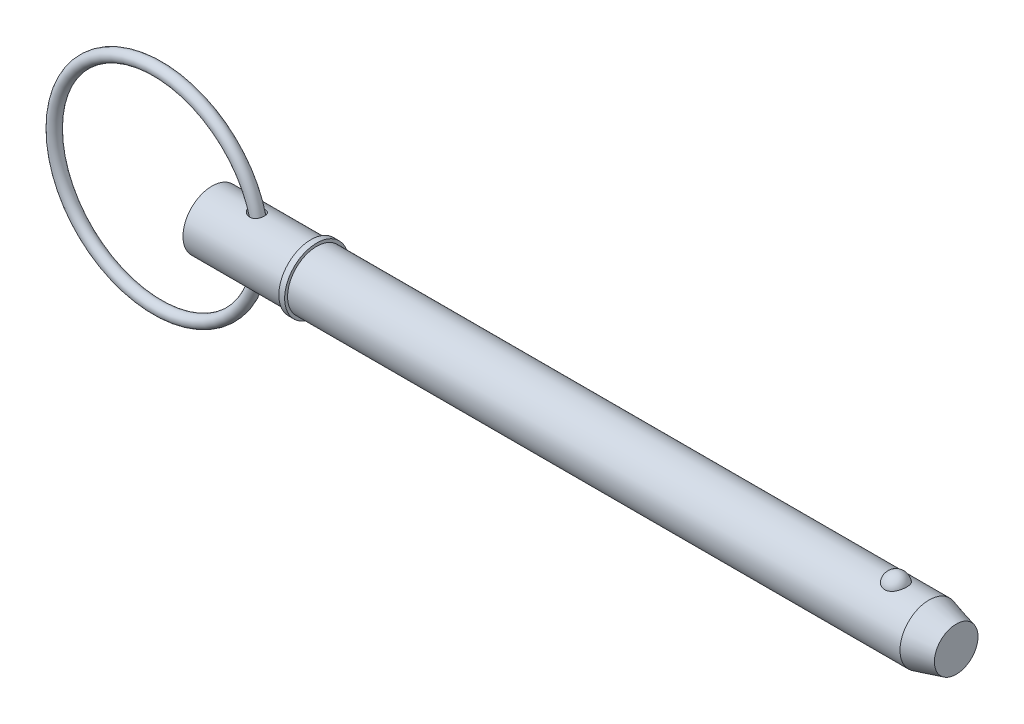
ISO-10303-21;
HEADER;
FILE_DESCRIPTION(('STEP AP214'),'2;1');
FILE_NAME('part.step','',(''),(''),'','','');
FILE_SCHEMA(('AUTOMOTIVE_DESIGN { 1 0 10303 214 1 1 1 1 }'));
ENDSEC;
DATA;
#1=APPLICATION_CONTEXT('core data for automotive mechanical design processes');
#2=APPLICATION_PROTOCOL_DEFINITION('international standard','automotive_design',2000,#1);
#3=PRODUCT_CONTEXT('',#1,'mechanical');
#4=PRODUCT('Part','Part','',(#3));
#5=PRODUCT_RELATED_PRODUCT_CATEGORY('part','',(#4));
#6=PRODUCT_DEFINITION_FORMATION('','',#4);
#7=PRODUCT_DEFINITION_CONTEXT('part definition',#1,'design');
#8=PRODUCT_DEFINITION('design','',#6,#7);
#9=PRODUCT_DEFINITION_SHAPE('','',#8);
#10=(LENGTH_UNIT() NAMED_UNIT(*) SI_UNIT(.MILLI.,.METRE.));
#11=(NAMED_UNIT(*) PLANE_ANGLE_UNIT() SI_UNIT($,.RADIAN.));
#12=(NAMED_UNIT(*) SI_UNIT($,.STERADIAN.) SOLID_ANGLE_UNIT());
#13=UNCERTAINTY_MEASURE_WITH_UNIT(LENGTH_MEASURE(1.E-05),#10,'distance_accuracy_value','');
#14=(GEOMETRIC_REPRESENTATION_CONTEXT(3) GLOBAL_UNCERTAINTY_ASSIGNED_CONTEXT((#13)) GLOBAL_UNIT_ASSIGNED_CONTEXT((#10,
#11,#12)) REPRESENTATION_CONTEXT('',''));
#15=CARTESIAN_POINT('',(0.,0.,0.));
#16=DIRECTION('',(0.,0.,1.));
#17=DIRECTION('',(1.,0.,0.));
#18=AXIS2_PLACEMENT_3D('',#15,#16,#17);
#19=CARTESIAN_POINT('',(-13.3805387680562,0.,0.));
#20=DIRECTION('',(0.,0.,1.));
#21=DIRECTION('',(1.,0.,0.));
#22=AXIS2_PLACEMENT_3D('',#19,#20,#21);
#23=TOROIDAL_SURFACE('',#22,25.4,1.429);
#24=CARTESIAN_POINT('',(13.4484612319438,0.,0.));
#25=VERTEX_POINT('',#24);
#26=VERTEX_LOOP('',#25);
#27=FACE_BOUND('',#26,.T.);
#28=ADVANCED_FACE('P0_F12',(#27),#23,.T.);
#29=CLOSED_SHELL('',(#28));
#30=MANIFOLD_SOLID_BREP('P0_B1',#29);
#31=CARTESIAN_POINT('',(0.,0.,0.));
#32=DIRECTION('',(1.,0.,0.));
#33=DIRECTION('',(0.,0.,-1.));
#34=AXIS2_PLACEMENT_3D('',#31,#32,#33);
#35=CYLINDRICAL_SURFACE('',#34,7.145);
#36=CARTESIAN_POINT('',(9.43029029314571,7.0820748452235,-0.94617170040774));
#37=CARTESIAN_POINT('',(9.49289741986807,7.07004660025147,-1.03619677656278));
#38=CARTESIAN_POINT('',(9.56370593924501,7.05703049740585,-1.12049617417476));
#39=CARTESIAN_POINT('',(9.71869321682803,7.03060933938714,-1.27585605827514));
#40=CARTESIAN_POINT('',(9.80290151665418,7.01720347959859,-1.34688652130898));
#41=CARTESIAN_POINT('',(9.98160385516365,6.99158714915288,-1.47408585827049));
#42=CARTESIAN_POINT('',(10.0760626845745,6.97937284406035,-1.53030346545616));
#43=CARTESIAN_POINT('',(10.2729508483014,6.95747410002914,-1.62697341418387));
#44=CARTESIAN_POINT('',(10.3753769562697,6.9477886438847,-1.66743209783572));
#45=CARTESIAN_POINT('',(10.5898946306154,6.93181594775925,-1.73266776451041));
#46=CARTESIAN_POINT('',(10.7022085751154,6.92567913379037,-1.75675727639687));
#47=CARTESIAN_POINT('',(10.9294935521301,6.91839634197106,-1.78523005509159));
#48=CARTESIAN_POINT('',(11.0444638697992,6.91724903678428,-1.78961856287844));
#49=CARTESIAN_POINT('',(11.2673249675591,6.92023954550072,-1.77801517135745));
#50=CARTESIAN_POINT('',(11.3752729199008,6.9241055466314,-1.7630715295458));
#51=CARTESIAN_POINT('',(11.5865707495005,6.93632220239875,-1.71437618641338));
#52=CARTESIAN_POINT('',(11.6899227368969,6.94467077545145,-1.68063321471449));
#53=CARTESIAN_POINT('',(11.8814537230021,6.96412118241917,-1.59802791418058));
#54=CARTESIAN_POINT('',(11.9701885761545,6.97498839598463,-1.55039425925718));
#55=CARTESIAN_POINT('',(12.1379548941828,6.99847346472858,-1.44066970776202));
#56=CARTESIAN_POINT('',(12.216987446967,7.01109112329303,-1.37858043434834));
#57=CARTESIAN_POINT('',(12.3614636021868,7.03632910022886,-1.24326778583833));
#58=CARTESIAN_POINT('',(12.4271729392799,7.04894297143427,-1.17032635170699));
#59=CARTESIAN_POINT('',(12.5455377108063,7.07306867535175,-1.01436746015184));
#60=CARTESIAN_POINT('',(12.5981928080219,7.08458047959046,-0.931349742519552));
#61=CARTESIAN_POINT('',(12.6896059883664,7.10535787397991,-0.756770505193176));
#62=CARTESIAN_POINT('',(12.7282356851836,7.11460247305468,-0.665139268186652));
#63=CARTESIAN_POINT('',(12.7900431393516,7.12971795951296,-0.476541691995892));
#64=CARTESIAN_POINT('',(12.8132203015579,7.13558871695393,-0.379575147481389));
#65=CARTESIAN_POINT('',(12.843715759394,7.14336270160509,-0.182249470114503));
#66=CARTESIAN_POINT('',(12.8509095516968,7.14523477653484,-0.081869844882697));
#67=CARTESIAN_POINT('',(12.8489064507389,7.14471772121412,0.118715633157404));
#68=CARTESIAN_POINT('',(12.8397092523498,7.14232851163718,0.218921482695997));
#69=CARTESIAN_POINT('',(12.8051110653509,7.13353949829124,0.41644658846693));
#70=CARTESIAN_POINT('',(12.7796895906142,7.12713462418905,0.513762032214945));
#71=CARTESIAN_POINT('',(12.7132079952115,7.1110024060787,0.702607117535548));
#72=CARTESIAN_POINT('',(12.6721476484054,7.10127501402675,0.79413667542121));
#73=CARTESIAN_POINT('',(12.5754142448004,7.07957648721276,0.968687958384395));
#74=CARTESIAN_POINT('',(12.5197583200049,7.06760798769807,1.05171950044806));
#75=CARTESIAN_POINT('',(12.3951873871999,7.04275315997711,1.20699878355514));
#76=CARTESIAN_POINT('',(12.3262733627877,7.02986689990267,1.27924732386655));
#77=CARTESIAN_POINT('',(12.1775943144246,7.00473797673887,1.41035599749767));
#78=CARTESIAN_POINT('',(12.0979195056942,6.99249102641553,1.46931758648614));
#79=CARTESIAN_POINT('',(11.9295314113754,6.96991222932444,1.57295053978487));
#80=CARTESIAN_POINT('',(11.840819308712,6.9595801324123,1.61762377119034));
#81=CARTESIAN_POINT('',(11.6577653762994,6.9420462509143,1.69128599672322));
#82=CARTESIAN_POINT('',(11.5634812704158,6.93481718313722,1.72041226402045));
#83=CARTESIAN_POINT('',(11.3712731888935,6.92407027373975,1.76316901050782));
#84=CARTESIAN_POINT('',(11.2733489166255,6.92055273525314,1.7767982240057));
#85=CARTESIAN_POINT('',(11.0745092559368,6.91745053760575,1.78883853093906));
#86=CARTESIAN_POINT('',(10.9735737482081,6.91794816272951,1.7869312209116));
#87=CARTESIAN_POINT('',(10.7732766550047,6.92286647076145,1.76777696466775));
#88=CARTESIAN_POINT('',(10.6739155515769,6.92728833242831,1.75052540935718));
#89=CARTESIAN_POINT('',(10.4726907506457,6.93987626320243,1.69995986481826));
#90=CARTESIAN_POINT('',(10.3710860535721,6.94826759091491,1.66567223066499));
#91=CARTESIAN_POINT('',(10.1746512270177,6.96783543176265,1.5818155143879));
#92=CARTESIAN_POINT('',(10.0798244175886,6.97901329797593,1.53223900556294));
#93=CARTESIAN_POINT('',(9.89353725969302,7.00369413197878,1.41530336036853));
#94=CARTESIAN_POINT('',(9.80266896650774,7.01729943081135,1.34701798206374));
#95=CARTESIAN_POINT('',(9.63408859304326,7.0446567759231,1.19571433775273));
#96=CARTESIAN_POINT('',(9.55637809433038,7.05840883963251,1.11269430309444));
#97=CARTESIAN_POINT('',(9.41909992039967,7.083998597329,0.935821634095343));
#98=CARTESIAN_POINT('',(9.35912834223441,7.09587546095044,0.842290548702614));
#99=CARTESIAN_POINT('',(9.25811978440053,7.11649414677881,0.645207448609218));
#100=CARTESIAN_POINT('',(9.21705789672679,7.12524008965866,0.541668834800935));
#101=CARTESIAN_POINT('',(9.16044503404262,7.13745944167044,0.341322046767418));
#102=CARTESIAN_POINT('',(9.14237352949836,7.14144984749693,0.245257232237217));
#103=CARTESIAN_POINT('',(9.12416132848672,7.14547143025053,0.0513577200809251));
#104=CARTESIAN_POINT('',(9.12401221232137,7.14550446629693,-0.0464761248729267));
#105=CARTESIAN_POINT('',(9.14075660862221,7.14180686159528,-0.230866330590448));
#106=CARTESIAN_POINT('',(9.15598246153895,7.13844450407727,-0.317588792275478));
#107=CARTESIAN_POINT('',(9.20015637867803,7.1288735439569,-0.487231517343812));
#108=CARTESIAN_POINT('',(9.22909411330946,7.12266708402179,-0.570154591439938));
#109=CARTESIAN_POINT('',(9.2869632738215,7.11060500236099,-0.702183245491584));
#110=CARTESIAN_POINT('',(9.3123377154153,7.10538970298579,-0.752949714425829));
#111=CARTESIAN_POINT('',(9.36784352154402,7.09422889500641,-0.851709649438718));
#112=CARTESIAN_POINT('',(9.39797435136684,7.08828346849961,-0.899703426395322));
#113=CARTESIAN_POINT('',(9.43029029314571,7.0820748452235,-0.94617170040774));
#114=B_SPLINE_CURVE_WITH_KNOTS('',3,(#36,#37,#38,#39,#40,#41,#42,#43,#44,#45,#46,#47,#48,#49,
#50,#51,#52,#53,#54,#55,#56,#57,#58,#59,#60,#61,#62,#63,#64,#65,#66,#67,#68,#69,#70,#71,#72,#73,
#74,#75,#76,#77,#78,#79,#80,#81,#82,#83,#84,#85,#86,#87,#88,#89,#90,#91,#92,#93,#94,#95,#96,#97,
#98,#99,#100,#101,#102,#103,#104,#105,#106,#107,#108,#109,#110,#111,#112,#113),.UNSPECIFIED.,
.T.,.F.,(4,2,2,2,2,2,2,2,2,2,2,2,2,2,2,2,2,2,2,2,2,2,2,2,2,2,2,2,2,2,2,2,2,2,2,2,2,2,4),(0.,
0.330712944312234,0.662165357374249,0.992513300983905,1.32272815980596,1.66607248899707,
2.00932547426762,2.33472339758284,2.65997034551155,2.96236844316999,3.26473260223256,
3.56029376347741,3.85586255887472,4.15407251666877,4.45229395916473,4.75283038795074,
5.05337241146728,5.35429467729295,5.6552212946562,5.95579625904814,6.25634893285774,
6.55452242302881,6.85265693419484,7.14811357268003,7.44359434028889,7.74514565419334,
8.04678757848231,8.36809025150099,8.68954924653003,9.03133562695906,9.37316306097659,
9.70647113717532,10.0393389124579,10.3311793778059,10.6228827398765,10.8860177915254,
11.1489549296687,11.3196783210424,11.4903825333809),.UNSPECIFIED.);
#115=CARTESIAN_POINT('',(9.43029029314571,7.0820748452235,-0.94617170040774));
#116=VERTEX_POINT('',#115);
#117=EDGE_CURVE('P1_E42',#116,#116,#114,.T.);
#118=ORIENTED_EDGE('',*,*,#117,.T.);
#119=EDGE_LOOP('',(#118));
#120=FACE_BOUND('',#119,.T.);
#121=CARTESIAN_POINT('',(0.,0.,0.));
#122=DIRECTION('',(1.,0.,0.));
#123=DIRECTION('',(0.,0.,-1.));
#124=AXIS2_PLACEMENT_3D('',#121,#122,#123);
#125=CIRCLE('',#124,7.145);
#126=CARTESIAN_POINT('',(0.,0.,-7.145));
#127=VERTEX_POINT('',#126);
#128=EDGE_CURVE('P1_E9',#127,#127,#125,.T.);
#129=ORIENTED_EDGE('',*,*,#128,.T.);
#130=EDGE_LOOP('',(#129));
#131=FACE_BOUND('',#130,.T.);
#132=CARTESIAN_POINT('',(24.271,0.,0.));
#133=DIRECTION('',(1.,0.,0.));
#134=DIRECTION('',(0.,0.,-1.));
#135=AXIS2_PLACEMENT_3D('',#132,#133,#134);
#136=CIRCLE('',#135,7.145);
#137=CARTESIAN_POINT('',(24.271,0.,-7.145));
#138=VERTEX_POINT('',#137);
#139=EDGE_CURVE('P1_E25',#138,#138,#136,.T.);
#140=ORIENTED_EDGE('',*,*,#139,.F.);
#141=EDGE_LOOP('',(#140));
#142=FACE_BOUND('',#141,.T.);
#143=CARTESIAN_POINT('',(9.43029029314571,-7.0820748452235,-0.94617170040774));
#144=CARTESIAN_POINT('',(9.37760063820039,-7.09219753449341,-0.870403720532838));
#145=CARTESIAN_POINT('',(9.33068640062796,-7.10162619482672,-0.790535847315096));
#146=CARTESIAN_POINT('',(9.25028000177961,-7.11818229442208,-0.624083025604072));
#147=CARTESIAN_POINT('',(9.21677847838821,-7.12531133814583,-0.53750281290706));
#148=CARTESIAN_POINT('',(9.16475883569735,-7.13651886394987,-0.359324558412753));
#149=CARTESIAN_POINT('',(9.14630423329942,-7.14058440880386,-0.267706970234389));
#150=CARTESIAN_POINT('',(9.12573334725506,-7.14512216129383,-0.082561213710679));
#151=CARTESIAN_POINT('',(9.12361335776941,-7.1455951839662,0.0109665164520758));
#152=CARTESIAN_POINT('',(9.13548667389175,-7.14296952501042,0.191627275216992));
#153=CARTESIAN_POINT('',(9.14858103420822,-7.14007009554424,0.278824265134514));
#154=CARTESIAN_POINT('',(9.18869656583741,-7.1313430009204,0.449782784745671));
#155=CARTESIAN_POINT('',(9.21571947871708,-7.1255149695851,0.533543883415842));
#156=CARTESIAN_POINT('',(9.282939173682,-7.11140544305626,0.696984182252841));
#157=CARTESIAN_POINT('',(9.32334793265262,-7.10308469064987,0.776572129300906));
#158=CARTESIAN_POINT('',(9.41555290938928,-7.08481187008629,0.928623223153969));
#159=CARTESIAN_POINT('',(9.4673531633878,-7.07485922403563,1.00108383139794));
#160=CARTESIAN_POINT('',(9.58690514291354,-7.05302654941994,1.14530893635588));
#161=CARTESIAN_POINT('',(9.65578345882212,-7.04105486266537,1.21612477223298));
#162=CARTESIAN_POINT('',(9.80342908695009,-7.01727063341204,1.34660507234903));
#163=CARTESIAN_POINT('',(9.88220203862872,-7.00545818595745,1.40626312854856));
#164=CARTESIAN_POINT('',(10.0573217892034,-6.9817739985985,1.51973713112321));
#165=CARTESIAN_POINT('',(10.1546474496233,-6.9700532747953,1.57208037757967));
#166=CARTESIAN_POINT('',(10.3567277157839,-6.94950828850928,1.66055104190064));
#167=CARTESIAN_POINT('',(10.4614845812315,-6.94068491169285,1.69667350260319));
#168=CARTESIAN_POINT('',(10.6792116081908,-6.92685379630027,1.75230777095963));
#169=CARTESIAN_POINT('',(10.7923373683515,-6.92197732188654,1.77125049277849));
#170=CARTESIAN_POINT('',(11.0202699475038,-6.91736328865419,1.78919210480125));
#171=CARTESIAN_POINT('',(11.1350759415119,-6.91762328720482,1.78820047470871));
#172=CARTESIAN_POINT('',(11.355627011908,-6.92328130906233,1.76615765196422));
#173=CARTESIAN_POINT('',(11.4615007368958,-6.92836826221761,1.74632083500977));
#174=CARTESIAN_POINT('',(11.6678083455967,-6.94272508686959,1.68833625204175));
#175=CARTESIAN_POINT('',(11.7682443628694,-6.9519933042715,1.65019572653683));
#176=CARTESIAN_POINT('',(11.9539217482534,-6.97285816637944,1.55957439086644));
#177=CARTESIAN_POINT('',(12.0397280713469,-6.98426147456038,1.50820229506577));
#178=CARTESIAN_POINT('',(12.2011249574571,-7.00842344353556,1.39160266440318));
#179=CARTESIAN_POINT('',(12.276716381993,-7.0211819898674,1.32637629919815));
#180=CARTESIAN_POINT('',(12.4144868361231,-7.04639315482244,1.18508369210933));
#181=CARTESIAN_POINT('',(12.4768620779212,-7.05884739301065,1.10920872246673));
#182=CARTESIAN_POINT('',(12.5881779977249,-7.08230185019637,0.947973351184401));
#183=CARTESIAN_POINT('',(12.6371182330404,-7.09330202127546,0.862612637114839));
#184=CARTESIAN_POINT('',(12.7208404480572,-7.11277016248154,0.683871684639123));
#185=CARTESIAN_POINT('',(12.7554736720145,-7.12121129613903,0.590418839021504));
#186=CARTESIAN_POINT('',(12.8090653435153,-7.13450309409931,0.398877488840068));
#187=CARTESIAN_POINT('',(12.8280232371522,-7.13935363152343,0.300788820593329));
#188=CARTESIAN_POINT('',(12.8499077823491,-7.14496695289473,0.102058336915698));
#189=CARTESIAN_POINT('',(12.8527265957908,-7.14570223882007,0.0014038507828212));
#190=CARTESIAN_POINT('',(12.8419792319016,-7.14293198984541,-0.198968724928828));
#191=CARTESIAN_POINT('',(12.8284127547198,-7.13942637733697,-0.298686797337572));
#192=CARTESIAN_POINT('',(12.7851853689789,-7.12854635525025,-0.494442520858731));
#193=CARTESIAN_POINT('',(12.7555107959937,-7.12116866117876,-0.590476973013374));
#194=CARTESIAN_POINT('',(12.6807437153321,-7.10334272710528,-0.776042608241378));
#195=CARTESIAN_POINT('',(12.6356510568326,-7.09289445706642,-0.865573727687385));
#196=CARTESIAN_POINT('',(12.5312128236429,-7.07009703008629,-1.03541867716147));
#197=CARTESIAN_POINT('',(12.4718917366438,-7.0577511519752,-1.11574799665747));
#198=CARTESIAN_POINT('',(12.3404461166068,-7.03252701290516,-1.26504204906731));
#199=CARTESIAN_POINT('',(12.2683227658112,-7.01964880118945,-1.33400783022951));
#200=CARTESIAN_POINT('',(12.1139052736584,-6.99493588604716,-1.45803732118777));
#201=CARTESIAN_POINT('',(12.031708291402,-6.98309284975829,-1.51322032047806));
#202=CARTESIAN_POINT('',(11.858962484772,-6.96164945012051,-1.60900039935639));
#203=CARTESIAN_POINT('',(11.7684146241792,-6.95204882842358,-1.6495991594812));
#204=CARTESIAN_POINT('',(11.5822744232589,-6.93618392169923,-1.71508374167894));
#205=CARTESIAN_POINT('',(11.4867225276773,-6.92989640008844,-1.74007923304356));
#206=CARTESIAN_POINT('',(11.292703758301,-6.92114809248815,-1.77455680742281));
#207=CARTESIAN_POINT('',(11.1942365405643,-6.91868775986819,-1.7840370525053));
#208=CARTESIAN_POINT('',(10.9943797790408,-6.91771041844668,-1.78782317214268));
#209=CARTESIAN_POINT('',(10.8929824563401,-6.9193005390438,-1.78171679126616));
#210=CARTESIAN_POINT('',(10.6924353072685,-6.92632816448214,-1.75419409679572));
#211=CARTESIAN_POINT('',(10.5932861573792,-6.93176681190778,-1.73277323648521));
#212=CARTESIAN_POINT('',(10.3927770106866,-6.94630717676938,-1.67356884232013));
#213=CARTESIAN_POINT('',(10.2917367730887,-6.95563581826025,-1.63475796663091));
#214=CARTESIAN_POINT('',(10.0971768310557,-6.97681957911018,-1.54184188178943));
#215=CARTESIAN_POINT('',(10.0036623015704,-6.9886764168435,-1.48772626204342));
#216=CARTESIAN_POINT('',(9.82098935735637,-7.01440230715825,-1.36146688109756));
#217=CARTESIAN_POINT('',(9.73247440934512,-7.0283510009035,-1.28840361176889));
#218=CARTESIAN_POINT('',(9.56978695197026,-7.05591334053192,-1.12770855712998));
#219=CARTESIAN_POINT('',(9.49560170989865,-7.06952727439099,-1.0400898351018));
#220=CARTESIAN_POINT('',(9.43029029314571,-7.0820748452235,-0.94617170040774));
#221=B_SPLINE_CURVE_WITH_KNOTS('',3,(#143,#144,#145,#146,#147,#148,#149,#150,#151,#152,#153,
#154,#155,#156,#157,#158,#159,#160,#161,#162,#163,#164,#165,#166,#167,#168,#169,#170,#171,#172,
#173,#174,#175,#176,#177,#178,#179,#180,#181,#182,#183,#184,#185,#186,#187,#188,#189,#190,#191,
#192,#193,#194,#195,#196,#197,#198,#199,#200,#201,#202,#203,#204,#205,#206,#207,#208,#209,#210,
#211,#212,#213,#214,#215,#216,#217,#218,#219,#220),.UNSPECIFIED.,.T.,.F.,(4,2,2,2,2,2,2,2,2,2,2,
2,2,2,2,2,2,2,2,2,2,2,2,2,2,2,2,2,2,2,2,2,2,2,2,2,2,2,4),(0.,0.278197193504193,
0.556199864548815,0.835370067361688,1.11447693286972,1.37789669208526,1.64134939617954,
1.90919123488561,2.17712812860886,2.47446254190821,2.77196719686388,3.10386520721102,
3.43586457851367,3.77849767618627,4.1209678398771,4.44276705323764,4.76443907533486,
5.0649452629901,5.36542609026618,5.66107282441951,5.95672929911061,6.25538683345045,
6.5540549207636,6.85471634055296,7.15538326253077,7.45630563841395,7.75723095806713,
8.05764204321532,8.35802540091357,8.65571107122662,8.95336242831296,9.24889743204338,
9.54446744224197,9.84793560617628,10.1514939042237,10.4760045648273,10.8007364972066,
11.1458836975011,11.4907227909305),.UNSPECIFIED.);
#222=CARTESIAN_POINT('',(9.43029029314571,-7.0820748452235,-0.94617170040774));
#223=VERTEX_POINT('',#222);
#224=EDGE_CURVE('P1_E17',#223,#223,#221,.T.);
#225=ORIENTED_EDGE('',*,*,#224,.T.);
#226=EDGE_LOOP('',(#225));
#227=FACE_BOUND('',#226,.T.);
#228=ADVANCED_FACE('P1_F13',(#120,#131,#142,#227),#35,.T.);
#229=CARTESIAN_POINT('',(0.,0.,0.));
#230=DIRECTION('',(1.,0.,0.));
#231=DIRECTION('',(0.,0.,-1.));
#232=AXIS2_PLACEMENT_3D('',#229,#230,#231);
#233=CYLINDRICAL_SURFACE('',#232,7.145);
#234=CARTESIAN_POINT('',(176.18362424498,0.,0.));
#235=DIRECTION('',(1.,0.,0.));
#236=DIRECTION('',(0.,0.,-1.));
#237=AXIS2_PLACEMENT_3D('',#234,#235,#236);
#238=CIRCLE('',#237,7.145);
#239=CARTESIAN_POINT('',(176.18362424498,0.,-7.145));
#240=VERTEX_POINT('',#239);
#241=EDGE_CURVE('P1_E99',#240,#240,#238,.T.);
#242=ORIENTED_EDGE('',*,*,#241,.F.);
#243=EDGE_LOOP('',(#242));
#244=FACE_BOUND('',#243,.T.);
#245=CARTESIAN_POINT('',(25.7,0.,0.));
#246=DIRECTION('',(1.,0.,0.));
#247=DIRECTION('',(0.,0.,-1.));
#248=AXIS2_PLACEMENT_3D('',#245,#246,#247);
#249=CIRCLE('',#248,7.145);
#250=CARTESIAN_POINT('',(25.7,0.,-7.145));
#251=VERTEX_POINT('',#250);
#252=EDGE_CURVE('P1_E96',#251,#251,#249,.T.);
#253=ORIENTED_EDGE('',*,*,#252,.T.);
#254=EDGE_LOOP('',(#253));
#255=FACE_BOUND('',#254,.T.);
#256=CARTESIAN_POINT('',(168.039503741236,6.60328629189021,2.72903557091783));
#257=CARTESIAN_POINT('',(167.898315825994,6.60329644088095,2.7290249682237));
#258=CARTESIAN_POINT('',(167.756883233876,6.60799490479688,2.71772840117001));
#259=CARTESIAN_POINT('',(167.477955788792,6.62628236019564,2.6728193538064));
#260=CARTESIAN_POINT('',(167.340472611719,6.63989534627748,2.63914664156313));
#261=CARTESIAN_POINT('',(167.073889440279,6.67440775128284,2.55059642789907));
#262=CARTESIAN_POINT('',(166.944768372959,6.69528793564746,2.49577486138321));
#263=CARTESIAN_POINT('',(166.697869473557,6.74205585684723,2.36651799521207));
#264=CARTESIAN_POINT('',(166.580086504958,6.76794130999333,2.2920916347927));
#265=CARTESIAN_POINT('',(166.35516710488,6.82286177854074,2.12312937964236));
#266=CARTESIAN_POINT('',(166.248440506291,6.85196655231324,2.0280710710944));
#267=CARTESIAN_POINT('',(166.051918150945,6.90970232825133,1.82167822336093));
#268=CARTESIAN_POINT('',(165.962127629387,6.93833318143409,1.71033867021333));
#269=CARTESIAN_POINT('',(165.797667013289,6.9935167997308,1.46891951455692));
#270=CARTESIAN_POINT('',(165.723844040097,7.01992110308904,1.33822781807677));
#271=CARTESIAN_POINT('',(165.598088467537,7.06643385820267,1.06566567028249));
#272=CARTESIAN_POINT('',(165.54615735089,7.08654188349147,0.923794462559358));
#273=CARTESIAN_POINT('',(165.464732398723,7.11862399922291,0.630993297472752));
#274=CARTESIAN_POINT('',(165.435516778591,7.13049704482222,0.479974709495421));
#275=CARTESIAN_POINT('',(165.401174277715,7.14449484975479,0.174782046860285));
#276=CARTESIAN_POINT('',(165.396046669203,7.14661990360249,0.0206080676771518));
#277=CARTESIAN_POINT('',(165.409938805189,7.14092465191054,-0.285506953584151));
#278=CARTESIAN_POINT('',(165.428810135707,7.1331654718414,-0.437455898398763));
#279=CARTESIAN_POINT('',(165.490062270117,7.10859076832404,-0.735778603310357));
#280=CARTESIAN_POINT('',(165.532443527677,7.0917750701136,-0.882152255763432));
#281=CARTESIAN_POINT('',(165.639934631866,7.05076716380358,-1.165431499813));
#282=CARTESIAN_POINT('',(165.705075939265,7.02656475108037,-1.30232366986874));
#283=CARTESIAN_POINT('',(165.856759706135,6.97329145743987,-1.56265907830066));
#284=CARTESIAN_POINT('',(165.943303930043,6.94422017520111,-1.68610120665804));
#285=CARTESIAN_POINT('',(166.136465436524,6.88415108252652,-1.91671004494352));
#286=CARTESIAN_POINT('',(166.243180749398,6.85314438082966,-2.02379244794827));
#287=CARTESIAN_POINT('',(166.473974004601,6.79282069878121,-2.21787433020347));
#288=CARTESIAN_POINT('',(166.598050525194,6.76350358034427,-2.30487545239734));
#289=CARTESIAN_POINT('',(166.857678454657,6.71060580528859,-2.45458647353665));
#290=CARTESIAN_POINT('',(166.992938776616,6.68691885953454,-2.51776240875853));
#291=CARTESIAN_POINT('',(167.273277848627,6.64741247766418,-2.62030218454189));
#292=CARTESIAN_POINT('',(167.418352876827,6.63159007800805,-2.65967499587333));
#293=CARTESIAN_POINT('',(167.706347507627,6.61038594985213,-2.71193301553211));
#294=CARTESIAN_POINT('',(167.84900807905,6.60451880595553,-2.72605165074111));
#295=CARTESIAN_POINT('',(168.134800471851,6.60240611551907,-2.73116688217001));
#296=CARTESIAN_POINT('',(168.277932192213,6.60615862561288,-2.7221681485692));
#297=CARTESIAN_POINT('',(168.555848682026,6.6225609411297,-2.68200435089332));
#298=CARTESIAN_POINT('',(168.690754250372,6.63492533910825,-2.65154998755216));
#299=CARTESIAN_POINT('',(168.95332009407,6.66687445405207,-2.57015684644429));
#300=CARTESIAN_POINT('',(169.08097978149,6.68645975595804,-2.51921640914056));
#301=CARTESIAN_POINT('',(169.328577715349,6.73127274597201,-2.39693610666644));
#302=CARTESIAN_POINT('',(169.448287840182,6.7566138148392,-2.32517694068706));
#303=CARTESIAN_POINT('',(169.674159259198,6.8100600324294,-2.16363812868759));
#304=CARTESIAN_POINT('',(169.780317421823,6.83816581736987,-2.07385432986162));
#305=CARTESIAN_POINT('',(169.981862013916,6.8958046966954,-1.87357235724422));
#306=CARTESIAN_POINT('',(170.076440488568,6.92533863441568,-1.76226074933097));
#307=CARTESIAN_POINT('',(170.246332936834,6.98139526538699,-1.5251169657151));
#308=CARTESIAN_POINT('',(170.321643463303,7.00791741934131,-1.39928219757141));
#309=CARTESIAN_POINT('',(170.453595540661,7.05607625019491,-1.13215977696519));
#310=CARTESIAN_POINT('',(170.509568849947,7.07753119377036,-0.990508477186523));
#311=CARTESIAN_POINT('',(170.598296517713,7.11222355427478,-0.699154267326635));
#312=CARTESIAN_POINT('',(170.631050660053,7.12546089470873,-0.54945128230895));
#313=CARTESIAN_POINT('',(170.672689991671,7.14237584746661,-0.246120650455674));
#314=CARTESIAN_POINT('',(170.681558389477,7.14604673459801,-0.0924903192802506));
#315=CARTESIAN_POINT('',(170.675194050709,7.14343510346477,0.21418173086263));
#316=CARTESIAN_POINT('',(170.659961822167,7.13715279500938,0.367223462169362));
#317=CARTESIAN_POINT('',(170.605845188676,7.1153294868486,0.667595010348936));
#318=CARTESIAN_POINT('',(170.567077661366,7.09983424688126,0.814949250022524));
#319=CARTESIAN_POINT('',(170.466770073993,7.06119140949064,1.10063221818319));
#320=CARTESIAN_POINT('',(170.405228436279,7.03804328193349,1.23896032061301));
#321=CARTESIAN_POINT('',(170.260207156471,6.98632429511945,1.50352300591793));
#322=CARTESIAN_POINT('',(170.176606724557,6.95772382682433,1.62968561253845));
#323=CARTESIAN_POINT('',(169.98938046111,6.89823072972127,1.86554304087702));
#324=CARTESIAN_POINT('',(169.885755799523,6.86733823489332,1.97523882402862));
#325=CARTESIAN_POINT('',(169.661076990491,6.80676456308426,2.174822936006));
#326=CARTESIAN_POINT('',(169.540067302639,6.7770805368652,2.26476035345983));
#327=CARTESIAN_POINT('',(169.283340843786,6.7223050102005,2.42252989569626));
#328=CARTESIAN_POINT('',(169.14761851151,6.69721525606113,2.49035362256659));
#329=CARTESIAN_POINT('',(168.870402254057,6.65552591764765,2.59967646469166));
#330=CARTESIAN_POINT('',(168.729281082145,6.63865794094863,2.64202017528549));
#331=CARTESIAN_POINT('',(168.441444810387,6.61425039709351,2.70255841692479));
#332=CARTESIAN_POINT('',(168.294748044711,6.606682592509,2.72082606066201));
#333=CARTESIAN_POINT('',(168.111679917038,6.60358754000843,2.72830331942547));
#334=CARTESIAN_POINT('',(168.075599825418,6.60328369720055,2.72903828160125));
#335=CARTESIAN_POINT('',(168.039503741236,6.60328629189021,2.72903557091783));
#336=B_SPLINE_CURVE_WITH_KNOTS('',3,(#256,#257,#258,#259,#260,#261,#262,#263,#264,#265,#266,
#267,#268,#269,#270,#271,#272,#273,#274,#275,#276,#277,#278,#279,#280,#281,#282,#283,#284,#285,
#286,#287,#288,#289,#290,#291,#292,#293,#294,#295,#296,#297,#298,#299,#300,#301,#302,#303,#304,
#305,#306,#307,#308,#309,#310,#311,#312,#313,#314,#315,#316,#317,#318,#319,#320,#321,#322,#323,
#324,#325,#326,#327,#328,#329,#330,#331,#332,#333,#334,#335),.UNSPECIFIED.,.T.,.F.,(4,2,2,2,2,2,
2,2,2,2,2,2,2,2,2,2,2,2,2,2,2,2,2,2,2,2,2,2,2,2,2,2,2,2,2,2,2,2,2,4),(0.,0.423468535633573,
0.848081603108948,1.27157926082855,1.69488414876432,2.13051395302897,2.56627819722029,
3.02136706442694,3.4764867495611,3.93709649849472,4.39769233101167,4.85545355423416,
5.31322361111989,5.77162895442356,6.23007210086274,6.69080337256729,7.15149693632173,
7.60264329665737,8.05361952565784,8.48189729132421,8.91008854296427,9.32472524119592,
9.73939553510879,10.1630783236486,10.5868588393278,11.0319070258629,11.4770347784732,
11.9362874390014,12.3955443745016,12.8551240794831,13.3146940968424,13.7720003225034,
14.2293382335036,14.6892343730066,15.1491036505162,15.6078171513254,16.0667046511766,
16.5093965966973,16.9507410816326,17.0590049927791),.UNSPECIFIED.);
#337=CARTESIAN_POINT('',(168.039503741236,6.60328629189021,2.72903557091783));
#338=VERTEX_POINT('',#337);
#339=EDGE_CURVE('P1_E34',#338,#338,#336,.T.);
#340=ORIENTED_EDGE('',*,*,#339,.T.);
#341=EDGE_LOOP('',(#340));
#342=FACE_BOUND('',#341,.T.);
#343=ADVANCED_FACE('P1_F46',(#244,#255,#342),#233,.T.);
#344=CARTESIAN_POINT('',(0.,0.,0.));
#345=DIRECTION('',(-1.,0.,0.));
#346=DIRECTION('',(0.,0.,1.));
#347=AXIS2_PLACEMENT_3D('',#344,#345,#346);
#348=PLANE('',#347);
#349=ORIENTED_EDGE('',*,*,#128,.F.);
#350=EDGE_LOOP('',(#349));
#351=FACE_BOUND('',#350,.T.);
#352=ADVANCED_FACE('P1_F15',(#351),#348,.T.);
#353=CARTESIAN_POINT('',(24.271,7.145,0.));
#354=DIRECTION('',(-1.,0.,0.));
#355=DIRECTION('',(0.,0.,1.));
#356=AXIS2_PLACEMENT_3D('',#353,#354,#355);
#357=PLANE('',#356);
#358=ORIENTED_EDGE('',*,*,#139,.T.);
#359=EDGE_LOOP('',(#358));
#360=FACE_BOUND('',#359,.T.);
#361=CARTESIAN_POINT('',(24.271,0.,0.));
#362=DIRECTION('',(1.,0.,0.));
#363=DIRECTION('',(0.,0.,-1.));
#364=AXIS2_PLACEMENT_3D('',#361,#362,#363);
#365=CIRCLE('',#364,7.8595);
#366=CARTESIAN_POINT('',(24.271,0.,-7.8595));
#367=VERTEX_POINT('',#366);
#368=EDGE_CURVE('P1_E30',#367,#367,#365,.T.);
#369=ORIENTED_EDGE('',*,*,#368,.F.);
#370=EDGE_LOOP('',(#369));
#371=FACE_BOUND('',#370,.T.);
#372=ADVANCED_FACE('P1_F81',(#360,#371),#357,.T.);
#373=CARTESIAN_POINT('',(0.,0.,0.));
#374=DIRECTION('',(1.,0.,0.));
#375=DIRECTION('',(0.,0.,-1.));
#376=AXIS2_PLACEMENT_3D('',#373,#374,#375);
#377=CYLINDRICAL_SURFACE('',#376,7.8595);
#378=ORIENTED_EDGE('',*,*,#368,.T.);
#379=EDGE_LOOP('',(#378));
#380=FACE_BOUND('',#379,.T.);
#381=CARTESIAN_POINT('',(25.7,0.,0.));
#382=DIRECTION('',(1.,0.,0.));
#383=DIRECTION('',(0.,0.,-1.));
#384=AXIS2_PLACEMENT_3D('',#381,#382,#383);
#385=CIRCLE('',#384,7.8595);
#386=CARTESIAN_POINT('',(25.7,0.,-7.8595));
#387=VERTEX_POINT('',#386);
#388=EDGE_CURVE('P1_E95',#387,#387,#385,.T.);
#389=ORIENTED_EDGE('',*,*,#388,.F.);
#390=EDGE_LOOP('',(#389));
#391=FACE_BOUND('',#390,.T.);
#392=ADVANCED_FACE('P1_F68',(#380,#391),#377,.T.);
#393=CARTESIAN_POINT('',(25.7,7.8595,0.));
#394=DIRECTION('',(1.,0.,0.));
#395=DIRECTION('',(0.,0.,-1.));
#396=AXIS2_PLACEMENT_3D('',#393,#394,#395);
#397=PLANE('',#396);
#398=ORIENTED_EDGE('',*,*,#388,.T.);
#399=EDGE_LOOP('',(#398));
#400=FACE_BOUND('',#399,.T.);
#401=ORIENTED_EDGE('',*,*,#252,.F.);
#402=EDGE_LOOP('',(#401));
#403=FACE_BOUND('',#402,.T.);
#404=ADVANCED_FACE('P1_F62',(#400,#403),#397,.T.);
#405=CARTESIAN_POINT('',(182.85,0.,0.));
#406=DIRECTION('',(-1.,0.,0.));
#407=DIRECTION('',(0.,0.,1.));
#408=AXIS2_PLACEMENT_3D('',#405,#406,#407);
#409=CONICAL_SURFACE('',#408,5.35875000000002,0.26179938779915);
#410=ORIENTED_EDGE('',*,*,#241,.T.);
#411=EDGE_LOOP('',(#410));
#412=FACE_BOUND('',#411,.T.);
#413=CARTESIAN_POINT('',(182.85,0.,0.));
#414=DIRECTION('',(1.,0.,0.));
#415=DIRECTION('',(0.,0.,-1.));
#416=AXIS2_PLACEMENT_3D('',#413,#414,#415);
#417=CIRCLE('',#416,5.35875000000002);
#418=CARTESIAN_POINT('',(182.85,0.,-5.35875000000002));
#419=VERTEX_POINT('',#418);
#420=EDGE_CURVE('P1_E41',#419,#419,#417,.T.);
#421=ORIENTED_EDGE('',*,*,#420,.F.);
#422=EDGE_LOOP('',(#421));
#423=FACE_BOUND('',#422,.T.);
#424=ADVANCED_FACE('P1_F59',(#412,#423),#409,.T.);
#425=CARTESIAN_POINT('',(182.85,5.35875000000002,0.));
#426=DIRECTION('',(1.,0.,0.));
#427=DIRECTION('',(0.,0.,-1.));
#428=AXIS2_PLACEMENT_3D('',#425,#426,#427);
#429=PLANE('',#428);
#430=ORIENTED_EDGE('',*,*,#420,.T.);
#431=EDGE_LOOP('',(#430));
#432=FACE_BOUND('',#431,.T.);
#433=ADVANCED_FACE('P1_F55',(#432),#429,.T.);
#434=CARTESIAN_POINT('',(168.039503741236,6.43049999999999,0.));
#435=DIRECTION('',(-1.,0.,0.));
#436=DIRECTION('',(0.,1.,0.));
#437=AXIS2_PLACEMENT_3D('',#434,#435,#436);
#438=SPHERICAL_SURFACE('',#437,2.7345);
#439=ORIENTED_EDGE('',*,*,#339,.F.);
#440=EDGE_LOOP('',(#439));
#441=FACE_BOUND('',#440,.T.);
#442=ADVANCED_FACE('P1_F50',(#441),#438,.T.);
#443=CARTESIAN_POINT('',(-13.3805387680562,0.,0.));
#444=DIRECTION('',(0.,0.,1.));
#445=DIRECTION('',(1.,0.,0.));
#446=AXIS2_PLACEMENT_3D('',#443,#444,#445);
#447=TOROIDAL_SURFACE('',#446,25.4,1.78625);
#448=ORIENTED_EDGE('',*,*,#224,.F.);
#449=EDGE_LOOP('',(#448));
#450=FACE_BOUND('',#449,.T.);
#451=ORIENTED_EDGE('',*,*,#117,.F.);
#452=EDGE_LOOP('',(#451));
#453=FACE_BOUND('',#452,.T.);
#454=ADVANCED_FACE('P1_F54',(#450,#453),#447,.F.);
#455=CLOSED_SHELL('',(#228,#343,#352,#372,#392,#404,#424,#433,#442,#454));
#456=MANIFOLD_SOLID_BREP('P1_B1',#455);
#457=ADVANCED_BREP_SHAPE_REPRESENTATION('',(#18,#30,#456),#14);
#458=SHAPE_DEFINITION_REPRESENTATION(#9,#457);
ENDSEC;
END-ISO-10303-21;
